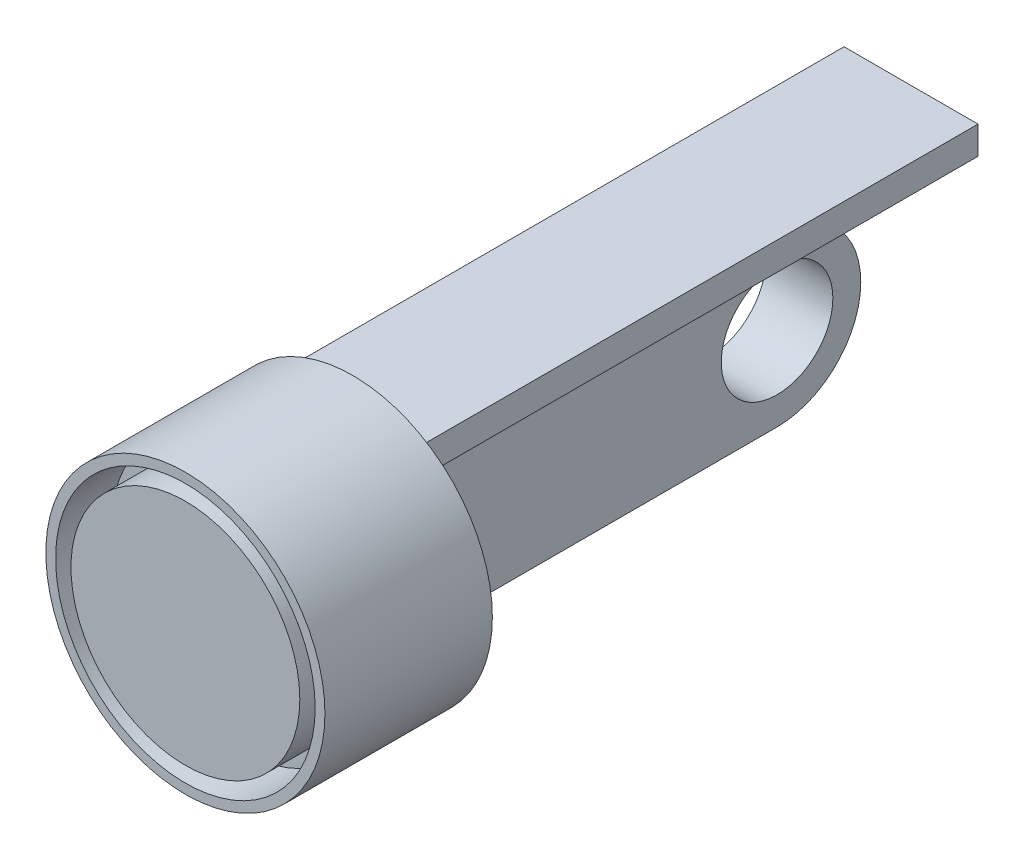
ISO-10303-21;
HEADER;
FILE_DESCRIPTION(('STEP AP214'),'2;1');
FILE_NAME('part.step','',(''),(''),'','','');
FILE_SCHEMA(('AUTOMOTIVE_DESIGN { 1 0 10303 214 1 1 1 1 }'));
ENDSEC;
DATA;
#1=APPLICATION_CONTEXT('core data for automotive mechanical design processes');
#2=APPLICATION_PROTOCOL_DEFINITION('international standard','automotive_design',2000,#1);
#3=PRODUCT_CONTEXT('',#1,'mechanical');
#4=PRODUCT('Part','Part','',(#3));
#5=PRODUCT_RELATED_PRODUCT_CATEGORY('part','',(#4));
#6=PRODUCT_DEFINITION_FORMATION('','',#4);
#7=PRODUCT_DEFINITION_CONTEXT('part definition',#1,'design');
#8=PRODUCT_DEFINITION('design','',#6,#7);
#9=PRODUCT_DEFINITION_SHAPE('','',#8);
#10=(LENGTH_UNIT() NAMED_UNIT(*) SI_UNIT(.MILLI.,.METRE.));
#11=(NAMED_UNIT(*) PLANE_ANGLE_UNIT() SI_UNIT($,.RADIAN.));
#12=(NAMED_UNIT(*) SI_UNIT($,.STERADIAN.) SOLID_ANGLE_UNIT());
#13=UNCERTAINTY_MEASURE_WITH_UNIT(LENGTH_MEASURE(1.E-05),#10,'distance_accuracy_value','');
#14=(GEOMETRIC_REPRESENTATION_CONTEXT(3) GLOBAL_UNCERTAINTY_ASSIGNED_CONTEXT((#13)) GLOBAL_UNIT_ASSIGNED_CONTEXT((#10,
#11,#12)) REPRESENTATION_CONTEXT('',''));
#15=CARTESIAN_POINT('',(0.,0.,0.));
#16=DIRECTION('',(0.,0.,1.));
#17=DIRECTION('',(1.,0.,0.));
#18=AXIS2_PLACEMENT_3D('',#15,#16,#17);
#19=CARTESIAN_POINT('',(0.,0.,30.));
#20=DIRECTION('',(0.,0.,-1.));
#21=DIRECTION('',(-1.,0.,0.));
#22=AXIS2_PLACEMENT_3D('',#19,#20,#21);
#23=CYLINDRICAL_SURFACE('',#22,25.);
#24=CARTESIAN_POINT('',(0.,0.,30.));
#25=DIRECTION('',(0.,0.,1.));
#26=DIRECTION('',(1.,0.,0.));
#27=AXIS2_PLACEMENT_3D('',#24,#25,#26);
#28=CIRCLE('',#27,25.);
#29=CARTESIAN_POINT('',(25.,0.,30.));
#30=VERTEX_POINT('',#29);
#31=EDGE_CURVE('E11',#30,#30,#28,.T.);
#32=ORIENTED_EDGE('',*,*,#31,.F.);
#33=EDGE_LOOP('',(#32));
#34=FACE_BOUND('',#33,.T.);
#35=CARTESIAN_POINT('',(0.,0.,0.));
#36=DIRECTION('',(0.,0.,1.));
#37=DIRECTION('',(1.,0.,0.));
#38=AXIS2_PLACEMENT_3D('',#35,#36,#37);
#39=CIRCLE('',#38,25.);
#40=CARTESIAN_POINT('',(25.,0.,0.));
#41=VERTEX_POINT('',#40);
#42=EDGE_CURVE('E42',#41,#41,#39,.T.);
#43=ORIENTED_EDGE('',*,*,#42,.T.);
#44=EDGE_LOOP('',(#43));
#45=FACE_BOUND('',#44,.T.);
#46=ADVANCED_FACE('F39',(#34,#45),#23,.T.);
#47=CARTESIAN_POINT('',(0.,0.,30.));
#48=DIRECTION('',(0.,0.,1.));
#49=DIRECTION('',(1.,0.,0.));
#50=AXIS2_PLACEMENT_3D('',#47,#48,#49);
#51=PLANE('',#50);
#52=CARTESIAN_POINT('',(0.,0.,30.));
#53=DIRECTION('',(0.,0.,1.));
#54=DIRECTION('',(1.,0.,0.));
#55=AXIS2_PLACEMENT_3D('',#52,#53,#54);
#56=CIRCLE('',#55,23.25);
#57=CARTESIAN_POINT('',(23.25,0.,30.));
#58=VERTEX_POINT('',#57);
#59=EDGE_CURVE('E352',#58,#58,#56,.T.);
#60=ORIENTED_EDGE('',*,*,#59,.F.);
#61=EDGE_LOOP('',(#60));
#62=FACE_BOUND('',#61,.T.);
#63=ORIENTED_EDGE('',*,*,#31,.T.);
#64=EDGE_LOOP('',(#63));
#65=FACE_BOUND('',#64,.T.);
#66=ADVANCED_FACE('F237',(#62,#65),#51,.T.);
#67=CARTESIAN_POINT('',(0.,0.,0.));
#68=DIRECTION('',(0.,0.,1.));
#69=DIRECTION('',(1.,0.,0.));
#70=AXIS2_PLACEMENT_3D('',#67,#68,#69);
#71=PLANE('',#70);
#72=DIRECTION('',(0.,-1.,0.));
#73=VECTOR('',#72,1.);
#74=CARTESIAN_POINT('',(-12.,20.,0.));
#75=LINE('',#74,#73);
#76=CARTESIAN_POINT('',(-12.,20.,0.));
#77=VERTEX_POINT('',#76);
#78=CARTESIAN_POINT('',(-12.,15.,0.));
#79=VERTEX_POINT('',#78);
#80=EDGE_CURVE('E140',#77,#79,#75,.T.);
#81=ORIENTED_EDGE('',*,*,#80,.T.);
#82=DIRECTION('',(1.,0.,0.));
#83=VECTOR('',#82,1.);
#84=CARTESIAN_POINT('',(12.,15.,0.));
#85=LINE('',#84,#83);
#86=CARTESIAN_POINT('',(-6.,15.,0.));
#87=VERTEX_POINT('',#86);
#88=EDGE_CURVE('E127',#79,#87,#85,.T.);
#89=ORIENTED_EDGE('',*,*,#88,.T.);
#90=DIRECTION('',(0.,-1.,0.));
#91=VECTOR('',#90,1.);
#92=CARTESIAN_POINT('',(-6.,15.,0.));
#93=LINE('',#92,#91);
#94=CARTESIAN_POINT('',(-6.,-15.,0.));
#95=VERTEX_POINT('',#94);
#96=EDGE_CURVE('E163',#87,#95,#93,.T.);
#97=ORIENTED_EDGE('',*,*,#96,.T.);
#98=DIRECTION('',(1.,0.,0.));
#99=VECTOR('',#98,1.);
#100=CARTESIAN_POINT('',(-6.,-15.,0.));
#101=LINE('',#100,#99);
#102=CARTESIAN_POINT('',(6.,-15.,0.));
#103=VERTEX_POINT('',#102);
#104=EDGE_CURVE('E175',#95,#103,#101,.T.);
#105=ORIENTED_EDGE('',*,*,#104,.T.);
#106=DIRECTION('',(0.,-1.,0.));
#107=VECTOR('',#106,1.);
#108=CARTESIAN_POINT('',(6.,15.,0.));
#109=LINE('',#108,#107);
#110=CARTESIAN_POINT('',(6.,15.,0.));
#111=VERTEX_POINT('',#110);
#112=EDGE_CURVE('E138',#111,#103,#109,.T.);
#113=ORIENTED_EDGE('',*,*,#112,.F.);
#114=CARTESIAN_POINT('',(12.,15.,0.));
#115=VERTEX_POINT('',#114);
#116=EDGE_CURVE('E198',#111,#115,#85,.T.);
#117=ORIENTED_EDGE('',*,*,#116,.T.);
#118=DIRECTION('',(0.,-1.,0.));
#119=VECTOR('',#118,1.);
#120=CARTESIAN_POINT('',(12.,20.,0.));
#121=LINE('',#120,#119);
#122=CARTESIAN_POINT('',(12.,20.,0.));
#123=VERTEX_POINT('',#122);
#124=EDGE_CURVE('E212',#123,#115,#121,.T.);
#125=ORIENTED_EDGE('',*,*,#124,.F.);
#126=DIRECTION('',(1.,0.,0.));
#127=VECTOR('',#126,1.);
#128=CARTESIAN_POINT('',(12.,20.,0.));
#129=LINE('',#128,#127);
#130=EDGE_CURVE('E123',#77,#123,#129,.T.);
#131=ORIENTED_EDGE('',*,*,#130,.F.);
#132=EDGE_LOOP('',(#81,#89,#97,#105,#113,#117,#125,#131));
#133=FACE_BOUND('',#132,.T.);
#134=ORIENTED_EDGE('',*,*,#42,.F.);
#135=EDGE_LOOP('',(#134));
#136=FACE_BOUND('',#135,.T.);
#137=ADVANCED_FACE('F187',(#133,#136),#71,.F.);
#138=CARTESIAN_POINT('',(-6.,0.,-70.));
#139=DIRECTION('',(1.,0.,0.));
#140=DIRECTION('',(0.,0.,-1.));
#141=AXIS2_PLACEMENT_3D('',#138,#139,#140);
#142=CYLINDRICAL_SURFACE('',#141,15.);
#143=DIRECTION('',(1.,0.,0.));
#144=VECTOR('',#143,1.);
#145=CARTESIAN_POINT('',(-6.,15.,-70.));
#146=LINE('',#145,#144);
#147=CARTESIAN_POINT('',(-6.,15.,-70.));
#148=VERTEX_POINT('',#147);
#149=CARTESIAN_POINT('',(6.,15.,-70.));
#150=VERTEX_POINT('',#149);
#151=EDGE_CURVE('E176',#148,#150,#146,.T.);
#152=ORIENTED_EDGE('',*,*,#151,.T.);
#153=CARTESIAN_POINT('',(6.,0.,-70.));
#154=DIRECTION('',(1.,0.,0.));
#155=DIRECTION('',(0.,0.,1.));
#156=AXIS2_PLACEMENT_3D('',#153,#154,#155);
#157=CIRCLE('',#156,15.);
#158=CARTESIAN_POINT('',(6.,-15.,-70.));
#159=VERTEX_POINT('',#158);
#160=EDGE_CURVE('E151',#159,#150,#157,.T.);
#161=ORIENTED_EDGE('',*,*,#160,.F.);
#162=DIRECTION('',(1.,0.,0.));
#163=VECTOR('',#162,1.);
#164=CARTESIAN_POINT('',(-6.,-15.,-70.));
#165=LINE('',#164,#163);
#166=CARTESIAN_POINT('',(-6.,-15.,-70.));
#167=VERTEX_POINT('',#166);
#168=EDGE_CURVE('E62',#167,#159,#165,.T.);
#169=ORIENTED_EDGE('',*,*,#168,.F.);
#170=CARTESIAN_POINT('',(-6.,0.,-70.));
#171=DIRECTION('',(1.,0.,0.));
#172=DIRECTION('',(0.,0.,1.));
#173=AXIS2_PLACEMENT_3D('',#170,#171,#172);
#174=CIRCLE('',#173,15.);
#175=EDGE_CURVE('E169',#167,#148,#174,.T.);
#176=ORIENTED_EDGE('',*,*,#175,.T.);
#177=EDGE_LOOP('',(#152,#161,#169,#176));
#178=FACE_BOUND('',#177,.T.);
#179=ADVANCED_FACE('F199',(#178),#142,.T.);
#180=CARTESIAN_POINT('',(-6.,-15.,0.));
#181=DIRECTION('',(0.,-1.,0.));
#182=DIRECTION('',(0.,0.,-1.));
#183=AXIS2_PLACEMENT_3D('',#180,#181,#182);
#184=PLANE('',#183);
#185=ORIENTED_EDGE('',*,*,#168,.T.);
#186=DIRECTION('',(0.,0.,-1.));
#187=VECTOR('',#186,1.);
#188=CARTESIAN_POINT('',(6.,-15.,0.));
#189=LINE('',#188,#187);
#190=EDGE_CURVE('E147',#103,#159,#189,.T.);
#191=ORIENTED_EDGE('',*,*,#190,.F.);
#192=ORIENTED_EDGE('',*,*,#104,.F.);
#193=DIRECTION('',(0.,0.,-1.));
#194=VECTOR('',#193,1.);
#195=CARTESIAN_POINT('',(-6.,-15.,0.));
#196=LINE('',#195,#194);
#197=EDGE_CURVE('E54',#95,#167,#196,.T.);
#198=ORIENTED_EDGE('',*,*,#197,.T.);
#199=EDGE_LOOP('',(#185,#191,#192,#198));
#200=FACE_BOUND('',#199,.T.);
#201=ADVANCED_FACE('F192',(#200),#184,.T.);
#202=CARTESIAN_POINT('',(-6.,0.,-70.));
#203=DIRECTION('',(-1.,0.,0.));
#204=DIRECTION('',(0.,0.,1.));
#205=AXIS2_PLACEMENT_3D('',#202,#203,#204);
#206=PLANE('',#205);
#207=CARTESIAN_POINT('',(-6.,0.,-70.));
#208=DIRECTION('',(1.,0.,0.));
#209=DIRECTION('',(0.,0.,-1.));
#210=AXIS2_PLACEMENT_3D('',#207,#208,#209);
#211=CIRCLE('',#210,9.99999999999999);
#212=CARTESIAN_POINT('',(-6.,0.,-80.));
#213=VERTEX_POINT('',#212);
#214=EDGE_CURVE('E159',#213,#213,#211,.T.);
#215=ORIENTED_EDGE('',*,*,#214,.T.);
#216=EDGE_LOOP('',(#215));
#217=FACE_BOUND('',#216,.T.);
#218=ORIENTED_EDGE('',*,*,#96,.F.);
#219=DIRECTION('',(0.,0.,1.));
#220=VECTOR('',#219,1.);
#221=CARTESIAN_POINT('',(-6.,15.,0.));
#222=LINE('',#221,#220);
#223=EDGE_CURVE('E172',#148,#87,#222,.T.);
#224=ORIENTED_EDGE('',*,*,#223,.F.);
#225=ORIENTED_EDGE('',*,*,#175,.F.);
#226=ORIENTED_EDGE('',*,*,#197,.F.);
#227=EDGE_LOOP('',(#218,#224,#225,#226));
#228=FACE_BOUND('',#227,.T.);
#229=ADVANCED_FACE('F201',(#217,#228),#206,.T.);
#230=CARTESIAN_POINT('',(-6.,0.,-70.));
#231=DIRECTION('',(1.,0.,0.));
#232=DIRECTION('',(0.,0.,-1.));
#233=AXIS2_PLACEMENT_3D('',#230,#231,#232);
#234=CYLINDRICAL_SURFACE('',#233,9.99999999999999);
#235=ORIENTED_EDGE('',*,*,#214,.F.);
#236=EDGE_LOOP('',(#235));
#237=FACE_BOUND('',#236,.T.);
#238=CARTESIAN_POINT('',(6.,0.,-70.));
#239=DIRECTION('',(1.,0.,0.));
#240=DIRECTION('',(0.,0.,-1.));
#241=AXIS2_PLACEMENT_3D('',#238,#239,#240);
#242=CIRCLE('',#241,9.99999999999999);
#243=CARTESIAN_POINT('',(6.,0.,-80.));
#244=VERTEX_POINT('',#243);
#245=EDGE_CURVE('E133',#244,#244,#242,.T.);
#246=ORIENTED_EDGE('',*,*,#245,.T.);
#247=EDGE_LOOP('',(#246));
#248=FACE_BOUND('',#247,.T.);
#249=ADVANCED_FACE('F260',(#237,#248),#234,.F.);
#250=CARTESIAN_POINT('',(6.,0.,-70.));
#251=DIRECTION('',(-1.,0.,0.));
#252=DIRECTION('',(0.,0.,1.));
#253=AXIS2_PLACEMENT_3D('',#250,#251,#252);
#254=PLANE('',#253);
#255=ORIENTED_EDGE('',*,*,#112,.T.);
#256=ORIENTED_EDGE('',*,*,#190,.T.);
#257=ORIENTED_EDGE('',*,*,#160,.T.);
#258=DIRECTION('',(0.,0.,1.));
#259=VECTOR('',#258,1.);
#260=CARTESIAN_POINT('',(6.,15.,0.));
#261=LINE('',#260,#259);
#262=EDGE_CURVE('E155',#150,#111,#261,.T.);
#263=ORIENTED_EDGE('',*,*,#262,.T.);
#264=EDGE_LOOP('',(#255,#256,#257,#263));
#265=FACE_BOUND('',#264,.T.);
#266=ORIENTED_EDGE('',*,*,#245,.F.);
#267=EDGE_LOOP('',(#266));
#268=FACE_BOUND('',#267,.T.);
#269=ADVANCED_FACE('F194',(#265,#268),#254,.F.);
#270=CARTESIAN_POINT('',(12.,20.,-100.));
#271=DIRECTION('',(-1.,0.,0.));
#272=DIRECTION('',(0.,0.,1.));
#273=AXIS2_PLACEMENT_3D('',#270,#271,#272);
#274=PLANE('',#273);
#275=DIRECTION('',(0.,0.,-1.));
#276=VECTOR('',#275,1.);
#277=CARTESIAN_POINT('',(12.,15.,-100.));
#278=LINE('',#277,#276);
#279=CARTESIAN_POINT('',(12.,15.,-100.));
#280=VERTEX_POINT('',#279);
#281=EDGE_CURVE('E131',#115,#280,#278,.T.);
#282=ORIENTED_EDGE('',*,*,#281,.T.);
#283=DIRECTION('',(0.,-1.,0.));
#284=VECTOR('',#283,1.);
#285=CARTESIAN_POINT('',(12.,20.,-100.));
#286=LINE('',#285,#284);
#287=CARTESIAN_POINT('',(12.,20.,-100.));
#288=VERTEX_POINT('',#287);
#289=EDGE_CURVE('E110',#288,#280,#286,.T.);
#290=ORIENTED_EDGE('',*,*,#289,.F.);
#291=DIRECTION('',(0.,0.,-1.));
#292=VECTOR('',#291,1.);
#293=CARTESIAN_POINT('',(12.,20.,-100.));
#294=LINE('',#293,#292);
#295=EDGE_CURVE('E118',#123,#288,#294,.T.);
#296=ORIENTED_EDGE('',*,*,#295,.F.);
#297=ORIENTED_EDGE('',*,*,#124,.T.);
#298=EDGE_LOOP('',(#282,#290,#296,#297));
#299=FACE_BOUND('',#298,.T.);
#300=ADVANCED_FACE('F129',(#299),#274,.F.);
#301=CARTESIAN_POINT('',(-12.,20.,-100.));
#302=DIRECTION('',(0.,0.,1.));
#303=DIRECTION('',(1.,0.,0.));
#304=AXIS2_PLACEMENT_3D('',#301,#302,#303);
#305=PLANE('',#304);
#306=DIRECTION('',(-1.,0.,0.));
#307=VECTOR('',#306,1.);
#308=CARTESIAN_POINT('',(-12.,15.,-100.));
#309=LINE('',#308,#307);
#310=CARTESIAN_POINT('',(-12.,15.,-100.));
#311=VERTEX_POINT('',#310);
#312=EDGE_CURVE('E221',#280,#311,#309,.T.);
#313=ORIENTED_EDGE('',*,*,#312,.T.);
#314=DIRECTION('',(0.,-1.,0.));
#315=VECTOR('',#314,1.);
#316=CARTESIAN_POINT('',(-12.,20.,-100.));
#317=LINE('',#316,#315);
#318=CARTESIAN_POINT('',(-12.,20.,-100.));
#319=VERTEX_POINT('',#318);
#320=EDGE_CURVE('E113',#319,#311,#317,.T.);
#321=ORIENTED_EDGE('',*,*,#320,.F.);
#322=DIRECTION('',(-1.,0.,0.));
#323=VECTOR('',#322,1.);
#324=CARTESIAN_POINT('',(-12.,20.,-100.));
#325=LINE('',#324,#323);
#326=EDGE_CURVE('E106',#288,#319,#325,.T.);
#327=ORIENTED_EDGE('',*,*,#326,.F.);
#328=ORIENTED_EDGE('',*,*,#289,.T.);
#329=EDGE_LOOP('',(#313,#321,#327,#328));
#330=FACE_BOUND('',#329,.T.);
#331=ADVANCED_FACE('F108',(#330),#305,.F.);
#332=CARTESIAN_POINT('',(-12.,20.,0.));
#333=DIRECTION('',(1.,0.,0.));
#334=DIRECTION('',(0.,0.,-1.));
#335=AXIS2_PLACEMENT_3D('',#332,#333,#334);
#336=PLANE('',#335);
#337=DIRECTION('',(0.,0.,1.));
#338=VECTOR('',#337,1.);
#339=CARTESIAN_POINT('',(-12.,15.,0.));
#340=LINE('',#339,#338);
#341=EDGE_CURVE('E208',#311,#79,#340,.T.);
#342=ORIENTED_EDGE('',*,*,#341,.T.);
#343=ORIENTED_EDGE('',*,*,#80,.F.);
#344=DIRECTION('',(0.,0.,1.));
#345=VECTOR('',#344,1.);
#346=CARTESIAN_POINT('',(-12.,20.,0.));
#347=LINE('',#346,#345);
#348=EDGE_CURVE('E117',#319,#77,#347,.T.);
#349=ORIENTED_EDGE('',*,*,#348,.F.);
#350=ORIENTED_EDGE('',*,*,#320,.T.);
#351=EDGE_LOOP('',(#342,#343,#349,#350));
#352=FACE_BOUND('',#351,.T.);
#353=ADVANCED_FACE('F226',(#352),#336,.F.);
#354=CARTESIAN_POINT('',(0.,20.,0.));
#355=DIRECTION('',(0.,-1.,0.));
#356=DIRECTION('',(0.,0.,-1.));
#357=AXIS2_PLACEMENT_3D('',#354,#355,#356);
#358=PLANE('',#357);
#359=ORIENTED_EDGE('',*,*,#295,.T.);
#360=ORIENTED_EDGE('',*,*,#326,.T.);
#361=ORIENTED_EDGE('',*,*,#348,.T.);
#362=ORIENTED_EDGE('',*,*,#130,.T.);
#363=EDGE_LOOP('',(#359,#360,#361,#362));
#364=FACE_BOUND('',#363,.T.);
#365=ADVANCED_FACE('F121',(#364),#358,.F.);
#366=CARTESIAN_POINT('',(0.,15.,0.));
#367=DIRECTION('',(0.,-1.,0.));
#368=DIRECTION('',(0.,0.,-1.));
#369=AXIS2_PLACEMENT_3D('',#366,#367,#368);
#370=PLANE('',#369);
#371=ORIENTED_EDGE('',*,*,#151,.F.);
#372=ORIENTED_EDGE('',*,*,#223,.T.);
#373=ORIENTED_EDGE('',*,*,#88,.F.);
#374=ORIENTED_EDGE('',*,*,#341,.F.);
#375=ORIENTED_EDGE('',*,*,#312,.F.);
#376=ORIENTED_EDGE('',*,*,#281,.F.);
#377=ORIENTED_EDGE('',*,*,#116,.F.);
#378=ORIENTED_EDGE('',*,*,#262,.F.);
#379=EDGE_LOOP('',(#371,#372,#373,#374,#375,#376,#377,#378));
#380=FACE_BOUND('',#379,.T.);
#381=ADVANCED_FACE('F197',(#380),#370,.T.);
#382=CARTESIAN_POINT('',(0.,0.,20.));
#383=DIRECTION('',(0.,0.,1.));
#384=DIRECTION('',(1.,0.,0.));
#385=AXIS2_PLACEMENT_3D('',#382,#383,#384);
#386=CYLINDRICAL_SURFACE('',#385,23.25);
#387=CARTESIAN_POINT('',(0.,0.,20.));
#388=DIRECTION('',(0.,0.,1.));
#389=DIRECTION('',(1.,0.,0.));
#390=AXIS2_PLACEMENT_3D('',#387,#388,#389);
#391=CIRCLE('',#390,23.25);
#392=CARTESIAN_POINT('',(23.25,0.,20.));
#393=VERTEX_POINT('',#392);
#394=EDGE_CURVE('E222',#393,#393,#391,.T.);
#395=ORIENTED_EDGE('',*,*,#394,.F.);
#396=EDGE_LOOP('',(#395));
#397=FACE_BOUND('',#396,.T.);
#398=ORIENTED_EDGE('',*,*,#59,.T.);
#399=EDGE_LOOP('',(#398));
#400=FACE_BOUND('',#399,.T.);
#401=ADVANCED_FACE('F295',(#397,#400),#386,.F.);
#402=CARTESIAN_POINT('',(0.,0.,20.));
#403=DIRECTION('',(0.,0.,1.));
#404=DIRECTION('',(1.,0.,0.));
#405=AXIS2_PLACEMENT_3D('',#402,#403,#404);
#406=PLANE('',#405);
#407=CARTESIAN_POINT('',(0.,0.,20.));
#408=DIRECTION('',(0.,0.,1.));
#409=DIRECTION('',(1.,0.,0.));
#410=AXIS2_PLACEMENT_3D('',#407,#408,#409);
#411=CIRCLE('',#410,20.5);
#412=CARTESIAN_POINT('',(20.5,0.,20.));
#413=VERTEX_POINT('',#412);
#414=EDGE_CURVE('E348',#413,#413,#411,.T.);
#415=ORIENTED_EDGE('',*,*,#414,.F.);
#416=EDGE_LOOP('',(#415));
#417=FACE_BOUND('',#416,.T.);
#418=ORIENTED_EDGE('',*,*,#394,.T.);
#419=EDGE_LOOP('',(#418));
#420=FACE_BOUND('',#419,.T.);
#421=ADVANCED_FACE('F312',(#417,#420),#406,.T.);
#422=CARTESIAN_POINT('',(0.,0.,20.));
#423=DIRECTION('',(0.,0.,1.));
#424=DIRECTION('',(1.,0.,0.));
#425=AXIS2_PLACEMENT_3D('',#422,#423,#424);
#426=CYLINDRICAL_SURFACE('',#425,20.5);
#427=ORIENTED_EDGE('',*,*,#414,.T.);
#428=EDGE_LOOP('',(#427));
#429=FACE_BOUND('',#428,.T.);
#430=CARTESIAN_POINT('',(0.,0.,30.));
#431=DIRECTION('',(0.,0.,1.));
#432=DIRECTION('',(1.,0.,0.));
#433=AXIS2_PLACEMENT_3D('',#430,#431,#432);
#434=CIRCLE('',#433,20.5);
#435=CARTESIAN_POINT('',(20.5,0.,30.));
#436=VERTEX_POINT('',#435);
#437=EDGE_CURVE('E345',#436,#436,#434,.T.);
#438=ORIENTED_EDGE('',*,*,#437,.F.);
#439=EDGE_LOOP('',(#438));
#440=FACE_BOUND('',#439,.T.);
#441=ADVANCED_FACE('F322',(#429,#440),#426,.T.);
#442=ORIENTED_EDGE('',*,*,#437,.T.);
#443=EDGE_LOOP('',(#442));
#444=FACE_BOUND('',#443,.T.);
#445=ADVANCED_FACE('F244',(#444),#51,.T.);
#446=CLOSED_SHELL('',(#46,#66,#137,#179,#201,#229,#249,#269,#300,#331,#353,#365,#381,#401,#421,
#441,#445));
#447=MANIFOLD_SOLID_BREP('B2',#446);
#448=ADVANCED_BREP_SHAPE_REPRESENTATION('',(#18,#447),#14);
#449=SHAPE_DEFINITION_REPRESENTATION(#9,#448);
ENDSEC;
END-ISO-10303-21;
